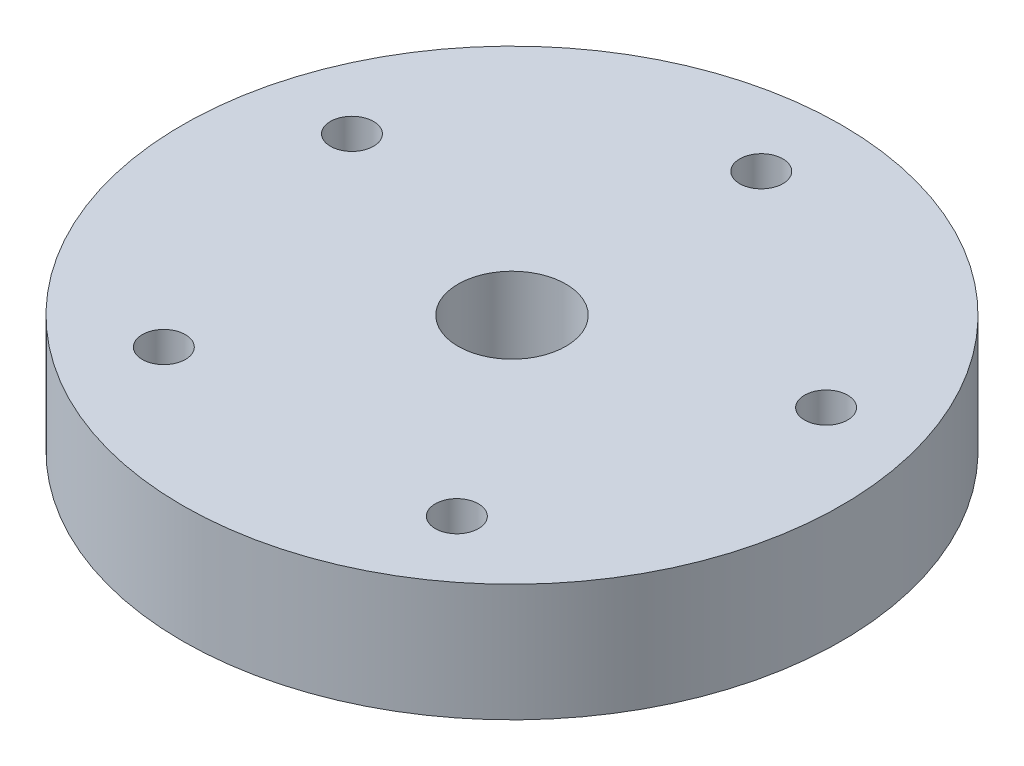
ISO-10303-21;
HEADER;
FILE_DESCRIPTION(('STEP AP214'),'2;1');
FILE_NAME('part.step','',(''),(''),'','','');
FILE_SCHEMA(('AUTOMOTIVE_DESIGN { 1 0 10303 214 1 1 1 1 }'));
ENDSEC;
DATA;
#1=APPLICATION_CONTEXT('core data for automotive mechanical design processes');
#2=APPLICATION_PROTOCOL_DEFINITION('international standard','automotive_design',2000,#1);
#3=PRODUCT_CONTEXT('',#1,'mechanical');
#4=PRODUCT('Part','Part','',(#3));
#5=PRODUCT_RELATED_PRODUCT_CATEGORY('part','',(#4));
#6=PRODUCT_DEFINITION_FORMATION('','',#4);
#7=PRODUCT_DEFINITION_CONTEXT('part definition',#1,'design');
#8=PRODUCT_DEFINITION('design','',#6,#7);
#9=PRODUCT_DEFINITION_SHAPE('','',#8);
#10=(LENGTH_UNIT() NAMED_UNIT(*) SI_UNIT(.MILLI.,.METRE.));
#11=(NAMED_UNIT(*) PLANE_ANGLE_UNIT() SI_UNIT($,.RADIAN.));
#12=(NAMED_UNIT(*) SI_UNIT($,.STERADIAN.) SOLID_ANGLE_UNIT());
#13=UNCERTAINTY_MEASURE_WITH_UNIT(LENGTH_MEASURE(1.E-05),#10,'distance_accuracy_value','');
#14=(GEOMETRIC_REPRESENTATION_CONTEXT(3) GLOBAL_UNCERTAINTY_ASSIGNED_CONTEXT((#13)) GLOBAL_UNIT_ASSIGNED_CONTEXT((#10,
#11,#12)) REPRESENTATION_CONTEXT('',''));
#15=CARTESIAN_POINT('',(0.,0.,0.));
#16=DIRECTION('',(0.,0.,1.));
#17=DIRECTION('',(1.,0.,0.));
#18=AXIS2_PLACEMENT_3D('',#15,#16,#17);
#19=CARTESIAN_POINT('',(0.,6.223,0.));
#20=DIRECTION('',(0.,1.,0.));
#21=DIRECTION('',(0.,0.,1.));
#22=AXIS2_PLACEMENT_3D('',#19,#20,#21);
#23=PLANE('',#22);
#24=CARTESIAN_POINT('',(-7.76346761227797,6.223,10.6854964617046));
#25=DIRECTION('',(0.,1.,0.));
#26=DIRECTION('',(0.,0.,1.));
#27=AXIS2_PLACEMENT_3D('',#24,#25,#26);
#28=CIRCLE('',#27,1.14300000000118);
#29=CARTESIAN_POINT('',(-7.76346761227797,6.223,11.8284964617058));
#30=VERTEX_POINT('',#29);
#31=EDGE_CURVE('E80',#30,#30,#28,.T.);
#32=ORIENTED_EDGE('',*,*,#31,.F.);
#33=EDGE_LOOP('',(#32));
#34=FACE_BOUND('',#33,.T.);
#35=CARTESIAN_POINT('',(12.5615544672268,6.223,-4.08149646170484));
#36=DIRECTION('',(0.,1.,0.));
#37=DIRECTION('',(0.,0.,1.));
#38=AXIS2_PLACEMENT_3D('',#35,#36,#37);
#39=CIRCLE('',#38,1.14300000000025);
#40=CARTESIAN_POINT('',(12.5615544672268,6.223,-2.93849646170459));
#41=VERTEX_POINT('',#40);
#42=EDGE_CURVE('E64',#41,#41,#39,.T.);
#43=ORIENTED_EDGE('',*,*,#42,.F.);
#44=EDGE_LOOP('',(#43));
#45=FACE_BOUND('',#44,.T.);
#46=CARTESIAN_POINT('',(0.,6.223,0.));
#47=DIRECTION('',(0.,1.,0.));
#48=DIRECTION('',(0.,0.,1.));
#49=AXIS2_PLACEMENT_3D('',#46,#47,#48);
#50=CIRCLE('',#49,2.8575);
#51=CARTESIAN_POINT('',(0.,6.223,2.8575));
#52=VERTEX_POINT('',#51);
#53=EDGE_CURVE('E50',#52,#52,#50,.T.);
#54=ORIENTED_EDGE('',*,*,#53,.F.);
#55=EDGE_LOOP('',(#54));
#56=FACE_BOUND('',#55,.T.);
#57=CARTESIAN_POINT('',(0.,6.223,0.));
#58=DIRECTION('',(0.,1.,0.));
#59=DIRECTION('',(0.,0.,1.));
#60=AXIS2_PLACEMENT_3D('',#57,#58,#59);
#61=CIRCLE('',#60,17.4625);
#62=CARTESIAN_POINT('',(0.,6.223,17.4625));
#63=VERTEX_POINT('',#62);
#64=EDGE_CURVE('E10',#63,#63,#61,.T.);
#65=ORIENTED_EDGE('',*,*,#64,.T.);
#66=EDGE_LOOP('',(#65));
#67=FACE_BOUND('',#66,.T.);
#68=CARTESIAN_POINT('',(0.,6.223,-13.208));
#69=DIRECTION('',(0.,1.,0.));
#70=DIRECTION('',(0.,0.,1.));
#71=AXIS2_PLACEMENT_3D('',#68,#69,#70);
#72=CIRCLE('',#71,1.143);
#73=CARTESIAN_POINT('',(0.,6.223,-12.065));
#74=VERTEX_POINT('',#73);
#75=EDGE_CURVE('E56',#74,#74,#72,.T.);
#76=ORIENTED_EDGE('',*,*,#75,.F.);
#77=EDGE_LOOP('',(#76));
#78=FACE_BOUND('',#77,.T.);
#79=CARTESIAN_POINT('',(7.76346761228,6.223,10.685496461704));
#80=DIRECTION('',(0.,1.,0.));
#81=DIRECTION('',(0.,0.,1.));
#82=AXIS2_PLACEMENT_3D('',#79,#80,#81);
#83=CIRCLE('',#82,1.14300000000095);
#84=CARTESIAN_POINT('',(7.76346761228,6.223,11.8284964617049));
#85=VERTEX_POINT('',#84);
#86=EDGE_CURVE('E72',#85,#85,#83,.T.);
#87=ORIENTED_EDGE('',*,*,#86,.F.);
#88=EDGE_LOOP('',(#87));
#89=FACE_BOUND('',#88,.T.);
#90=CARTESIAN_POINT('',(-12.561554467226,6.223,-4.08149646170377));
#91=DIRECTION('',(0.,1.,0.));
#92=DIRECTION('',(0.,0.,1.));
#93=AXIS2_PLACEMENT_3D('',#90,#91,#92);
#94=CIRCLE('',#93,1.14300000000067);
#95=CARTESIAN_POINT('',(-12.561554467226,6.223,-2.9384964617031));
#96=VERTEX_POINT('',#95);
#97=EDGE_CURVE('E88',#96,#96,#94,.T.);
#98=ORIENTED_EDGE('',*,*,#97,.F.);
#99=EDGE_LOOP('',(#98));
#100=FACE_BOUND('',#99,.T.);
#101=ADVANCED_FACE('F37',(#34,#45,#56,#67,#78,#89,#100),#23,.T.);
#102=CARTESIAN_POINT('',(0.,0.,0.));
#103=DIRECTION('',(0.,1.,0.));
#104=DIRECTION('',(0.,0.,1.));
#105=AXIS2_PLACEMENT_3D('',#102,#103,#104);
#106=PLANE('',#105);
#107=CARTESIAN_POINT('',(0.,0.,0.));
#108=DIRECTION('',(0.,1.,0.));
#109=DIRECTION('',(0.,0.,1.));
#110=AXIS2_PLACEMENT_3D('',#107,#108,#109);
#111=CIRCLE('',#110,17.4625);
#112=CARTESIAN_POINT('',(0.,0.,17.4625));
#113=VERTEX_POINT('',#112);
#114=EDGE_CURVE('E41',#113,#113,#111,.T.);
#115=ORIENTED_EDGE('',*,*,#114,.F.);
#116=EDGE_LOOP('',(#115));
#117=FACE_BOUND('',#116,.T.);
#118=CARTESIAN_POINT('',(0.,0.,0.));
#119=DIRECTION('',(0.,1.,0.));
#120=DIRECTION('',(0.,0.,1.));
#121=AXIS2_PLACEMENT_3D('',#118,#119,#120);
#122=CIRCLE('',#121,2.8575);
#123=CARTESIAN_POINT('',(0.,0.,2.8575));
#124=VERTEX_POINT('',#123);
#125=EDGE_CURVE('E52',#124,#124,#122,.T.);
#126=ORIENTED_EDGE('',*,*,#125,.T.);
#127=EDGE_LOOP('',(#126));
#128=FACE_BOUND('',#127,.T.);
#129=CARTESIAN_POINT('',(0.,0.,-13.208));
#130=DIRECTION('',(0.,1.,0.));
#131=DIRECTION('',(0.,0.,1.));
#132=AXIS2_PLACEMENT_3D('',#129,#130,#131);
#133=CIRCLE('',#132,1.143);
#134=CARTESIAN_POINT('',(0.,0.,-12.065));
#135=VERTEX_POINT('',#134);
#136=EDGE_CURVE('E60',#135,#135,#133,.T.);
#137=ORIENTED_EDGE('',*,*,#136,.T.);
#138=EDGE_LOOP('',(#137));
#139=FACE_BOUND('',#138,.T.);
#140=CARTESIAN_POINT('',(12.5615544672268,0.,-4.08149646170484));
#141=DIRECTION('',(0.,1.,0.));
#142=DIRECTION('',(0.,0.,1.));
#143=AXIS2_PLACEMENT_3D('',#140,#141,#142);
#144=CIRCLE('',#143,1.14300000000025);
#145=CARTESIAN_POINT('',(12.5615544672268,0.,-2.93849646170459));
#146=VERTEX_POINT('',#145);
#147=EDGE_CURVE('E68',#146,#146,#144,.T.);
#148=ORIENTED_EDGE('',*,*,#147,.T.);
#149=EDGE_LOOP('',(#148));
#150=FACE_BOUND('',#149,.T.);
#151=CARTESIAN_POINT('',(7.76346761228,0.,10.685496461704));
#152=DIRECTION('',(0.,1.,0.));
#153=DIRECTION('',(0.,0.,1.));
#154=AXIS2_PLACEMENT_3D('',#151,#152,#153);
#155=CIRCLE('',#154,1.14300000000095);
#156=CARTESIAN_POINT('',(7.76346761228,0.,11.8284964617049));
#157=VERTEX_POINT('',#156);
#158=EDGE_CURVE('E76',#157,#157,#155,.T.);
#159=ORIENTED_EDGE('',*,*,#158,.T.);
#160=EDGE_LOOP('',(#159));
#161=FACE_BOUND('',#160,.T.);
#162=CARTESIAN_POINT('',(-7.76346761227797,0.,10.6854964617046));
#163=DIRECTION('',(0.,1.,0.));
#164=DIRECTION('',(0.,0.,1.));
#165=AXIS2_PLACEMENT_3D('',#162,#163,#164);
#166=CIRCLE('',#165,1.14300000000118);
#167=CARTESIAN_POINT('',(-7.76346761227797,0.,11.8284964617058));
#168=VERTEX_POINT('',#167);
#169=EDGE_CURVE('E84',#168,#168,#166,.T.);
#170=ORIENTED_EDGE('',*,*,#169,.T.);
#171=EDGE_LOOP('',(#170));
#172=FACE_BOUND('',#171,.T.);
#173=CARTESIAN_POINT('',(-12.561554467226,0.,-4.08149646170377));
#174=DIRECTION('',(0.,1.,0.));
#175=DIRECTION('',(0.,0.,1.));
#176=AXIS2_PLACEMENT_3D('',#173,#174,#175);
#177=CIRCLE('',#176,1.14300000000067);
#178=CARTESIAN_POINT('',(-12.561554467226,0.,-2.9384964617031));
#179=VERTEX_POINT('',#178);
#180=EDGE_CURVE('E92',#179,#179,#177,.T.);
#181=ORIENTED_EDGE('',*,*,#180,.T.);
#182=EDGE_LOOP('',(#181));
#183=FACE_BOUND('',#182,.T.);
#184=ADVANCED_FACE('F104',(#117,#128,#139,#150,#161,#172,#183),#106,.F.);
#185=CARTESIAN_POINT('',(0.,6.223,0.));
#186=DIRECTION('',(0.,-1.,0.));
#187=DIRECTION('',(0.,0.,-1.));
#188=AXIS2_PLACEMENT_3D('',#185,#186,#187);
#189=CYLINDRICAL_SURFACE('',#188,17.4625);
#190=ORIENTED_EDGE('',*,*,#64,.F.);
#191=EDGE_LOOP('',(#190));
#192=FACE_BOUND('',#191,.T.);
#193=ORIENTED_EDGE('',*,*,#114,.T.);
#194=EDGE_LOOP('',(#193));
#195=FACE_BOUND('',#194,.T.);
#196=ADVANCED_FACE('F39',(#192,#195),#189,.T.);
#197=CARTESIAN_POINT('',(0.,6.223,0.));
#198=DIRECTION('',(0.,-1.,0.));
#199=DIRECTION('',(0.,0.,-1.));
#200=AXIS2_PLACEMENT_3D('',#197,#198,#199);
#201=CYLINDRICAL_SURFACE('',#200,2.8575);
#202=ORIENTED_EDGE('',*,*,#53,.T.);
#203=EDGE_LOOP('',(#202));
#204=FACE_BOUND('',#203,.T.);
#205=ORIENTED_EDGE('',*,*,#125,.F.);
#206=EDGE_LOOP('',(#205));
#207=FACE_BOUND('',#206,.T.);
#208=ADVANCED_FACE('F114',(#204,#207),#201,.F.);
#209=CARTESIAN_POINT('',(0.,6.223,-13.208));
#210=DIRECTION('',(0.,-1.,0.));
#211=DIRECTION('',(0.,0.,-1.));
#212=AXIS2_PLACEMENT_3D('',#209,#210,#211);
#213=CYLINDRICAL_SURFACE('',#212,1.143);
#214=ORIENTED_EDGE('',*,*,#75,.T.);
#215=EDGE_LOOP('',(#214));
#216=FACE_BOUND('',#215,.T.);
#217=ORIENTED_EDGE('',*,*,#136,.F.);
#218=EDGE_LOOP('',(#217));
#219=FACE_BOUND('',#218,.T.);
#220=ADVANCED_FACE('F117',(#216,#219),#213,.F.);
#221=CARTESIAN_POINT('',(12.5615544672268,6.223,-4.08149646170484));
#222=DIRECTION('',(0.,-1.,0.));
#223=DIRECTION('',(0.,0.,-1.));
#224=AXIS2_PLACEMENT_3D('',#221,#222,#223);
#225=CYLINDRICAL_SURFACE('',#224,1.14300000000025);
#226=ORIENTED_EDGE('',*,*,#42,.T.);
#227=EDGE_LOOP('',(#226));
#228=FACE_BOUND('',#227,.T.);
#229=ORIENTED_EDGE('',*,*,#147,.F.);
#230=EDGE_LOOP('',(#229));
#231=FACE_BOUND('',#230,.T.);
#232=ADVANCED_FACE('F121',(#228,#231),#225,.F.);
#233=CARTESIAN_POINT('',(7.76346761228,6.223,10.685496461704));
#234=DIRECTION('',(0.,-1.,0.));
#235=DIRECTION('',(0.,0.,-1.));
#236=AXIS2_PLACEMENT_3D('',#233,#234,#235);
#237=CYLINDRICAL_SURFACE('',#236,1.14300000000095);
#238=ORIENTED_EDGE('',*,*,#86,.T.);
#239=EDGE_LOOP('',(#238));
#240=FACE_BOUND('',#239,.T.);
#241=ORIENTED_EDGE('',*,*,#158,.F.);
#242=EDGE_LOOP('',(#241));
#243=FACE_BOUND('',#242,.T.);
#244=ADVANCED_FACE('F125',(#240,#243),#237,.F.);
#245=CARTESIAN_POINT('',(-7.76346761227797,6.223,10.6854964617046));
#246=DIRECTION('',(0.,-1.,0.));
#247=DIRECTION('',(0.,0.,-1.));
#248=AXIS2_PLACEMENT_3D('',#245,#246,#247);
#249=CYLINDRICAL_SURFACE('',#248,1.14300000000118);
#250=ORIENTED_EDGE('',*,*,#31,.T.);
#251=EDGE_LOOP('',(#250));
#252=FACE_BOUND('',#251,.T.);
#253=ORIENTED_EDGE('',*,*,#169,.F.);
#254=EDGE_LOOP('',(#253));
#255=FACE_BOUND('',#254,.T.);
#256=ADVANCED_FACE('F129',(#252,#255),#249,.F.);
#257=CARTESIAN_POINT('',(-12.561554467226,6.223,-4.08149646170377));
#258=DIRECTION('',(0.,-1.,0.));
#259=DIRECTION('',(0.,0.,-1.));
#260=AXIS2_PLACEMENT_3D('',#257,#258,#259);
#261=CYLINDRICAL_SURFACE('',#260,1.14300000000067);
#262=ORIENTED_EDGE('',*,*,#97,.T.);
#263=EDGE_LOOP('',(#262));
#264=FACE_BOUND('',#263,.T.);
#265=ORIENTED_EDGE('',*,*,#180,.F.);
#266=EDGE_LOOP('',(#265));
#267=FACE_BOUND('',#266,.T.);
#268=ADVANCED_FACE('F100',(#264,#267),#261,.F.);
#269=CLOSED_SHELL('',(#101,#184,#196,#208,#220,#232,#244,#256,#268));
#270=MANIFOLD_SOLID_BREP('B2',#269);
#271=ADVANCED_BREP_SHAPE_REPRESENTATION('',(#18,#270),#14);
#272=SHAPE_DEFINITION_REPRESENTATION(#9,#271);
ENDSEC;
END-ISO-10303-21;
